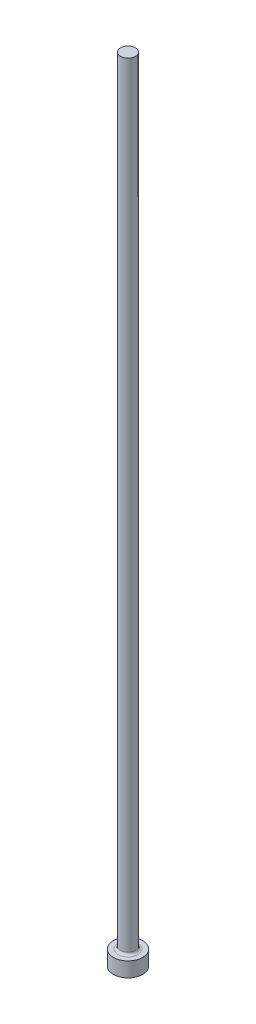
from build123d import *


with BuildPart() as part:
    # Sketch1 → Revolve1 (revolve)
    with BuildSketch(Plane.XY, mode=Mode.PRIVATE) as revolve1_sk:
        with BuildLine():
            Line((0, 0), (4.699, 0))
            Line((4.699, 0), (4.699, 4.7498))
            Line((4.699, 4.7498), (3.14325, 4.7498))
            ThreePointArc((3.14325, 4.7498), (2.604434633, 4.972984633), (2.38125, 5.5118))
            Line((2.38125, 5.5118), (2.38125, 254))
            Line((2.38125, 254), (0, 254))
            Line((0, 254), (0, 0))
        make_face()
    revolve(revolve1_sk.sketch.rotate(Axis((0, 254, 0), (0, -1, 0)), 180), axis=Axis((0, 254, 0), (0, -1, 0)))


solid = part.part
